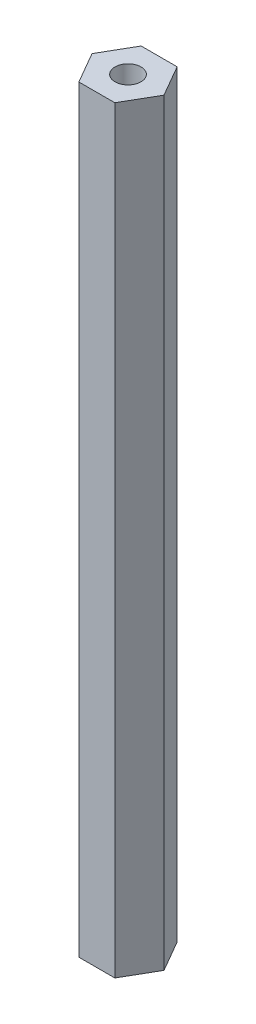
from build123d import *

# Parameters (mm, degrees)
RESSALTO_EXTRUS_O1_DEPTH = 73


with BuildPart() as part:
    # Esbo_o1 → Ressalto-extrus_o1 (new body)
    with BuildSketch(Plane(origin=(0, 0, 0), x_dir=(1, 0, 0), z_dir=(0, 1, 0))):
        Polygon((3.464101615, 0), (1.732050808, 3), (-1.732050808, 3), (-3.464101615, 0), (-1.732050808, -3), (1.732050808, -3), align=None)
    extrude(amount=RESSALTO_EXTRUS_O1_DEPTH)

    # Esbo_o8 → Furo roscado de M3x0.52 (revolve, cut)
    with BuildSketch(Plane(origin=(0, 0, 0), x_dir=(0, 0, -1), z_dir=(1, 0, 0))):
        Polygon((0, 0), (0, 12.751075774), (1.25, 12), (1.25, 0), align=None)
    furo_roscado_de_m3x0_52 = revolve(axis=Axis((0, -6.35, 0), (0, 1, 0)), mode=Mode.SUBTRACT)

    # Espelhar1: Furo roscado de M3x0.52 across plane
    add(furo_roscado_de_m3x0_52.mirror(Plane(origin=(0, 36.5, 0), x_dir=(0, 0, 1), z_dir=(0, -1, 0))), mode=Mode.SUBTRACT)


solid = part.part
